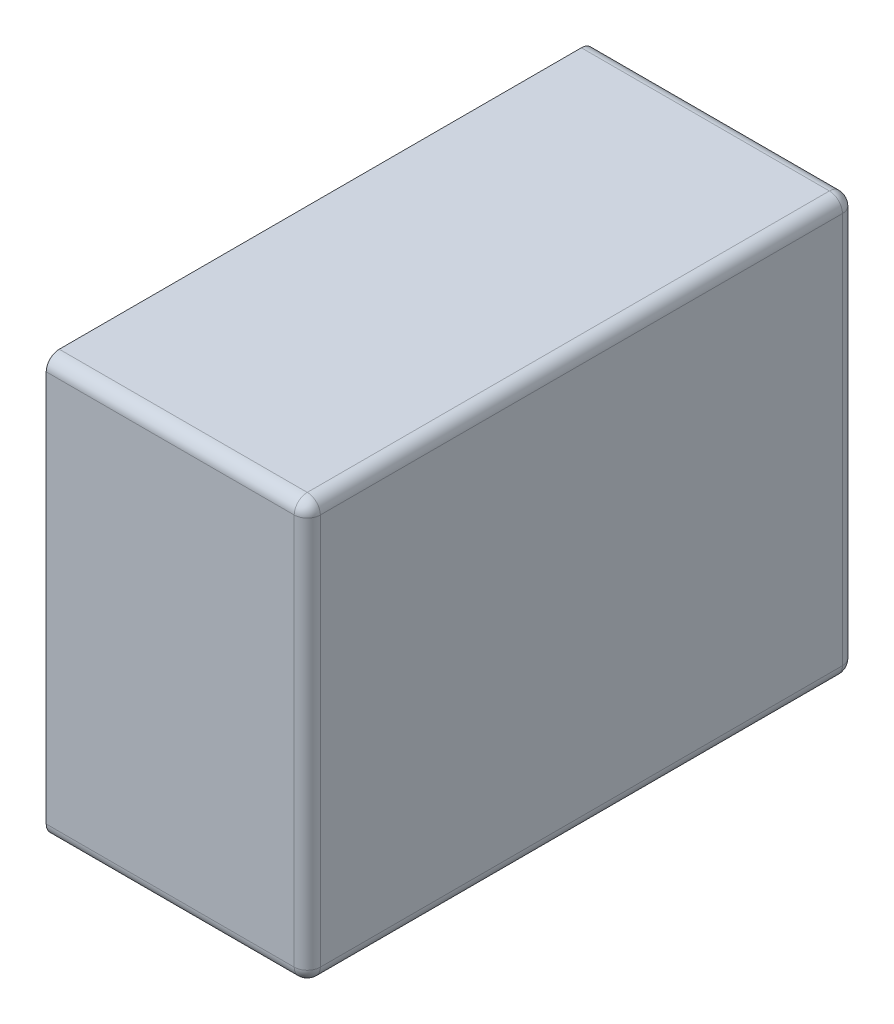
from build123d import *

# Parameters (mm, degrees)
SKETCH3_W           = 126
SKETCH3_H           = 96
BOSS_EXTRUDE3_DEPTH = 60
SKETCH5_W           = 124
SKETCH5_H           = 94
BOSS_EXTRUDE4_DEPTH = 1
SKETCH6_W           = 122
SKETCH6_H           = 92
CUT_EXTRUDE1_DEPTH  = 55
FILLET11_R          = 6
FILLET12_R          = 6
FILLET13_R          = 6
FILLET14_R          = 6
FILLET15_R          = 6
FILLET16_R          = 6
FILLET17_R          = 6
FILLET18_R          = 6
FILLET19_R          = 3
FILLET20_R          = 3
FILLET21_R          = 3
FILLET22_R          = 3
SKETCH8_R           = 3.5
CUT_EXTRUDE2_DEPTH  = 146.87666023
SKETCH9_R           = 6
CUT_EXTRUDE3_DEPTH  = 146.87666023
SKETCH10_R          = 6
CUT_EXTRUDE4_DEPTH  = 146.87666023


with BuildPart() as part:
    # Sketch3 → Boss-Extrude3 (new body)
    with BuildSketch(Plane(origin=(0, 0, 0), x_dir=(0, 0, -1), z_dir=(1, 0, 0))):
        Rectangle(SKETCH3_W, SKETCH3_H)
    extrude(amount=BOSS_EXTRUDE3_DEPTH)

    # Sketch5 → Boss-Extrude4 (add)
    with BuildSketch(Plane.ZY):
        Rectangle(SKETCH5_W, SKETCH5_H)
    extrude(amount=BOSS_EXTRUDE4_DEPTH)

    # Sketch6 → Cut-Extrude1 (cut)
    with BuildSketch(Plane.ZY.offset(1)):
        Rectangle(SKETCH6_W, SKETCH6_H)
    extrude(amount=-CUT_EXTRUDE1_DEPTH, mode=Mode.SUBTRACT)

    # Fillet11
    fillet11_edges = [part.edges().sort_by_distance(p)[0] for p in [
        (26.5, -46, 61),
    ]]
    fillet(fillet11_edges, radius=FILLET11_R)

    # Fillet12
    fillet12_edges = [part.edges().sort_by_distance(p)[0] for p in [
        (-0.5, -47, 62),
    ]]
    fillet(fillet12_edges, radius=FILLET12_R)

    # Fillet13
    fillet13_edges = [part.edges().sort_by_distance(p)[0] for p in [
        (26.5, 46, 61),
    ]]
    fillet(fillet13_edges, radius=FILLET13_R)

    # Fillet14
    fillet14_edges = [part.edges().sort_by_distance(p)[0] for p in [
        (-0.5, 47, 62),
    ]]
    fillet(fillet14_edges, radius=FILLET14_R)

    # Fillet15
    fillet15_edges = [part.edges().sort_by_distance(p)[0] for p in [
        (26.5, 46, -61),
    ]]
    fillet(fillet15_edges, radius=FILLET15_R)

    # Fillet16
    fillet16_edges = [part.edges().sort_by_distance(p)[0] for p in [
        (-0.5, 47, -62),
    ]]
    fillet(fillet16_edges, radius=FILLET16_R)

    # Fillet17
    fillet17_edges = [part.edges().sort_by_distance(p)[0] for p in [
        (26.5, -46, -61),
    ]]
    fillet(fillet17_edges, radius=FILLET17_R)

    # Fillet18
    fillet18_edges = [part.edges().sort_by_distance(p)[0] for p in [
        (-0.5, -47, -62),
    ]]
    fillet(fillet18_edges, radius=FILLET18_R)

    # Fillet19
    fillet19_edges = [part.edges().sort_by_distance(p)[0] for p in [
        (30, -48, -63),
    ]]
    fillet(fillet19_edges, radius=FILLET19_R)

    # Fillet20
    fillet20_edges = [part.edges().sort_by_distance(p)[0] for p in [
        (30, 48, -63),
    ]]
    fillet(fillet20_edges, radius=FILLET20_R)

    # Fillet21
    fillet21_edges = [part.edges().sort_by_distance(p)[0] for p in [
        (60, 47.121320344, -62.121320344),
        (60, -48, 1.5),
        (60, 0, -63),
        (60, -47.121320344, -62.121320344),
        (60, 48, 1.5),
    ]]
    fillet(fillet21_edges, radius=FILLET21_R)

    # Fillet22
    fillet22_edges = [part.edges().sort_by_distance(p)[0] for p in [
        (60, 0, 63),
        (28.5, -48, 63),
        (28.5, 48, 63),
        (59.121320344, 47.121320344, 63),
        (59.121320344, -47.121320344, 63),
    ]]
    fillet(fillet22_edges, radius=FILLET22_R)

    # Sketch8 → Cut-Extrude2 (cut, through all)
    with BuildSketch(Plane.XY.offset(-61)):
        with Locations((20.5, -20)):
            Circle(SKETCH8_R)
    extrude(amount=-CUT_EXTRUDE2_DEPTH, mode=Mode.SUBTRACT)

    # Sketch9 → Cut-Extrude3 (cut, through all)
    with BuildSketch(Plane.XY.offset(-61)):
        with Locations((20.5, 0)):
            Circle(SKETCH9_R)
    extrude(amount=-CUT_EXTRUDE3_DEPTH, mode=Mode.SUBTRACT)

    # Sketch10 → Cut-Extrude4 (cut, through all)
    with BuildSketch(Plane.XY.offset(-61)):
        with Locations((20.5, 20)):
            Circle(SKETCH10_R)
    extrude(amount=-CUT_EXTRUDE4_DEPTH, mode=Mode.SUBTRACT)


solid = part.part
